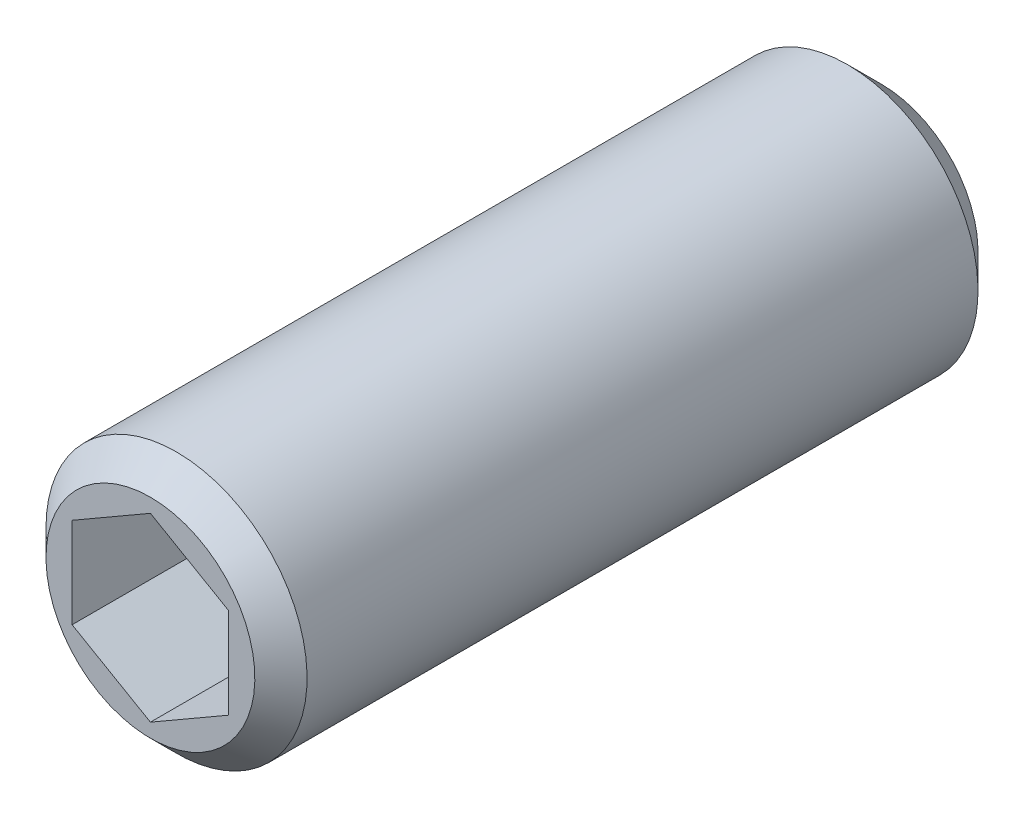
ISO-10303-21;
HEADER;
FILE_DESCRIPTION(('STEP AP214'),'2;1');
FILE_NAME('part.step','',(''),(''),'','','');
FILE_SCHEMA(('AUTOMOTIVE_DESIGN { 1 0 10303 214 1 1 1 1 }'));
ENDSEC;
DATA;
#1=APPLICATION_CONTEXT('core data for automotive mechanical design processes');
#2=APPLICATION_PROTOCOL_DEFINITION('international standard','automotive_design',2000,#1);
#3=PRODUCT_CONTEXT('',#1,'mechanical');
#4=PRODUCT('Part','Part','',(#3));
#5=PRODUCT_RELATED_PRODUCT_CATEGORY('part','',(#4));
#6=PRODUCT_DEFINITION_FORMATION('','',#4);
#7=PRODUCT_DEFINITION_CONTEXT('part definition',#1,'design');
#8=PRODUCT_DEFINITION('design','',#6,#7);
#9=PRODUCT_DEFINITION_SHAPE('','',#8);
#10=(LENGTH_UNIT() NAMED_UNIT(*) SI_UNIT(.MILLI.,.METRE.));
#11=(NAMED_UNIT(*) PLANE_ANGLE_UNIT() SI_UNIT($,.RADIAN.));
#12=(NAMED_UNIT(*) SI_UNIT($,.STERADIAN.) SOLID_ANGLE_UNIT());
#13=UNCERTAINTY_MEASURE_WITH_UNIT(LENGTH_MEASURE(1.E-05),#10,'distance_accuracy_value','');
#14=(GEOMETRIC_REPRESENTATION_CONTEXT(3) GLOBAL_UNCERTAINTY_ASSIGNED_CONTEXT((#13)) GLOBAL_UNIT_ASSIGNED_CONTEXT((#10,
#11,#12)) REPRESENTATION_CONTEXT('',''));
#15=CARTESIAN_POINT('',(0.,0.,0.));
#16=DIRECTION('',(0.,0.,1.));
#17=DIRECTION('',(1.,0.,0.));
#18=AXIS2_PLACEMENT_3D('',#15,#16,#17);
#19=CARTESIAN_POINT('',(0.,0.,14.9));
#20=DIRECTION('',(0.,0.,-1.));
#21=DIRECTION('',(0.,1.,0.));
#22=AXIS2_PLACEMENT_3D('',#19,#20,#21);
#23=PLANE('',#22);
#24=DIRECTION('',(0.866025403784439,0.5,0.));
#25=VECTOR('',#24,1.);
#26=CARTESIAN_POINT('',(0.,-1.73205080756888,14.9));
#27=LINE('',#26,#25);
#28=CARTESIAN_POINT('',(0.,-1.73205080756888,14.9));
#29=VERTEX_POINT('',#28);
#30=CARTESIAN_POINT('',(1.5,-0.866025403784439,14.9));
#31=VERTEX_POINT('',#30);
#32=EDGE_CURVE('E83',#29,#31,#27,.T.);
#33=ORIENTED_EDGE('',*,*,#32,.F.);
#34=DIRECTION('',(0.866025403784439,-0.5,0.));
#35=VECTOR('',#34,1.);
#36=CARTESIAN_POINT('',(-1.5,-0.866025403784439,14.9));
#37=LINE('',#36,#35);
#38=CARTESIAN_POINT('',(-1.5,-0.866025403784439,14.9));
#39=VERTEX_POINT('',#38);
#40=EDGE_CURVE('E29',#39,#29,#37,.T.);
#41=ORIENTED_EDGE('',*,*,#40,.F.);
#42=DIRECTION('',(0.,-1.,0.));
#43=VECTOR('',#42,1.);
#44=CARTESIAN_POINT('',(-1.5,0.866025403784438,14.9));
#45=LINE('',#44,#43);
#46=CARTESIAN_POINT('',(-1.5,0.866025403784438,14.9));
#47=VERTEX_POINT('',#46);
#48=EDGE_CURVE('E98',#47,#39,#45,.T.);
#49=ORIENTED_EDGE('',*,*,#48,.F.);
#50=DIRECTION('',(-0.866025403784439,-0.5,0.));
#51=VECTOR('',#50,1.);
#52=CARTESIAN_POINT('',(0.,1.73205080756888,14.9));
#53=LINE('',#52,#51);
#54=CARTESIAN_POINT('',(0.,1.73205080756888,14.9));
#55=VERTEX_POINT('',#54);
#56=EDGE_CURVE('E92',#55,#47,#53,.T.);
#57=ORIENTED_EDGE('',*,*,#56,.F.);
#58=DIRECTION('',(-0.866025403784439,0.5,0.));
#59=VECTOR('',#58,1.);
#60=CARTESIAN_POINT('',(1.5,0.866025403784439,14.9));
#61=LINE('',#60,#59);
#62=CARTESIAN_POINT('',(1.5,0.866025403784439,14.9));
#63=VERTEX_POINT('',#62);
#64=EDGE_CURVE('E90',#63,#55,#61,.T.);
#65=ORIENTED_EDGE('',*,*,#64,.F.);
#66=DIRECTION('',(0.,1.,0.));
#67=VECTOR('',#66,1.);
#68=CARTESIAN_POINT('',(1.5,-0.866025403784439,14.9));
#69=LINE('',#68,#67);
#70=EDGE_CURVE('E72',#31,#63,#69,.T.);
#71=ORIENTED_EDGE('',*,*,#70,.F.);
#72=EDGE_LOOP('',(#33,#41,#49,#57,#65,#71));
#73=FACE_BOUND('',#72,.T.);
#74=CARTESIAN_POINT('',(0.,0.,14.9));
#75=DIRECTION('',(0.,0.,-1.));
#76=DIRECTION('',(0.,1.,0.));
#77=AXIS2_PLACEMENT_3D('',#74,#75,#76);
#78=CIRCLE('',#77,2.);
#79=CARTESIAN_POINT('',(0.,2.,14.9));
#80=VERTEX_POINT('',#79);
#81=EDGE_CURVE('E9',#80,#80,#78,.F.);
#82=ORIENTED_EDGE('',*,*,#81,.T.);
#83=EDGE_LOOP('',(#82));
#84=FACE_BOUND('',#83,.T.);
#85=ADVANCED_FACE('F14',(#73,#84),#23,.F.);
#86=CARTESIAN_POINT('',(0.,0.,0.9));
#87=DIRECTION('',(0.,0.,1.));
#88=DIRECTION('',(0.,-1.,0.));
#89=AXIS2_PLACEMENT_3D('',#86,#87,#88);
#90=CYLINDRICAL_SURFACE('',#89,2.5);
#91=CARTESIAN_POINT('',(0.,0.,14.4));
#92=DIRECTION('',(0.,0.,-1.));
#93=DIRECTION('',(0.,1.,0.));
#94=AXIS2_PLACEMENT_3D('',#91,#92,#93);
#95=CIRCLE('',#94,2.5);
#96=CARTESIAN_POINT('',(0.,2.5,14.4));
#97=VERTEX_POINT('',#96);
#98=EDGE_CURVE('E22',#97,#97,#95,.T.);
#99=ORIENTED_EDGE('',*,*,#98,.T.);
#100=EDGE_LOOP('',(#99));
#101=FACE_BOUND('',#100,.T.);
#102=CARTESIAN_POINT('',(0.,0.,1.55));
#103=DIRECTION('',(0.,0.,-1.));
#104=DIRECTION('',(-1.,0.,0.));
#105=AXIS2_PLACEMENT_3D('',#102,#103,#104);
#106=CIRCLE('',#105,2.5);
#107=CARTESIAN_POINT('',(-2.5,0.,1.55));
#108=VERTEX_POINT('',#107);
#109=EDGE_CURVE('E267',#108,#108,#106,.T.);
#110=ORIENTED_EDGE('',*,*,#109,.F.);
#111=EDGE_LOOP('',(#110));
#112=FACE_BOUND('',#111,.T.);
#113=ADVANCED_FACE('F16',(#101,#112),#90,.T.);
#114=CARTESIAN_POINT('',(0.,0.,14.4));
#115=DIRECTION('',(0.,0.,-1.));
#116=DIRECTION('',(0.,1.,0.));
#117=AXIS2_PLACEMENT_3D('',#114,#115,#116);
#118=CONICAL_SURFACE('',#117,2.5,0.78539816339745);
#119=ORIENTED_EDGE('',*,*,#81,.F.);
#120=EDGE_LOOP('',(#119));
#121=FACE_BOUND('',#120,.T.);
#122=ORIENTED_EDGE('',*,*,#98,.F.);
#123=EDGE_LOOP('',(#122));
#124=FACE_BOUND('',#123,.T.);
#125=ADVANCED_FACE('F132',(#121,#124),#118,.T.);
#126=CARTESIAN_POINT('',(-1.5,-0.866025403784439,11.9));
#127=DIRECTION('',(-0.5,-0.866025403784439,0.));
#128=DIRECTION('',(-0.866025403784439,0.5,0.));
#129=AXIS2_PLACEMENT_3D('',#126,#127,#128);
#130=PLANE('',#129);
#131=ORIENTED_EDGE('',*,*,#40,.T.);
#132=DIRECTION('',(0.,0.,1.));
#133=VECTOR('',#132,1.);
#134=CARTESIAN_POINT('',(0.,-1.73205080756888,11.9));
#135=LINE('',#134,#133);
#136=CARTESIAN_POINT('',(0.,-1.73205080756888,11.9));
#137=VERTEX_POINT('',#136);
#138=EDGE_CURVE('E80',#137,#29,#135,.T.);
#139=ORIENTED_EDGE('',*,*,#138,.F.);
#140=DIRECTION('',(0.866025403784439,-0.5,0.));
#141=VECTOR('',#140,1.);
#142=CARTESIAN_POINT('',(-1.5,-0.866025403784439,11.9));
#143=LINE('',#142,#141);
#144=CARTESIAN_POINT('',(-1.5,-0.866025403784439,11.9));
#145=VERTEX_POINT('',#144);
#146=EDGE_CURVE('E100',#145,#137,#143,.T.);
#147=ORIENTED_EDGE('',*,*,#146,.F.);
#148=DIRECTION('',(0.,0.,1.));
#149=VECTOR('',#148,1.);
#150=CARTESIAN_POINT('',(-1.5,-0.866025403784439,11.9));
#151=LINE('',#150,#149);
#152=EDGE_CURVE('E36',#145,#39,#151,.T.);
#153=ORIENTED_EDGE('',*,*,#152,.T.);
#154=EDGE_LOOP('',(#131,#139,#147,#153));
#155=FACE_BOUND('',#154,.T.);
#156=ADVANCED_FACE('F134',(#155),#130,.F.);
#157=CARTESIAN_POINT('',(-1.5,0.866025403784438,11.9));
#158=DIRECTION('',(-1.,0.,0.));
#159=DIRECTION('',(0.,1.,0.));
#160=AXIS2_PLACEMENT_3D('',#157,#158,#159);
#161=PLANE('',#160);
#162=ORIENTED_EDGE('',*,*,#48,.T.);
#163=ORIENTED_EDGE('',*,*,#152,.F.);
#164=DIRECTION('',(0.,-1.,0.));
#165=VECTOR('',#164,1.);
#166=CARTESIAN_POINT('',(-1.5,0.866025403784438,11.9));
#167=LINE('',#166,#165);
#168=CARTESIAN_POINT('',(-1.5,0.866025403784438,11.9));
#169=VERTEX_POINT('',#168);
#170=EDGE_CURVE('E112',#169,#145,#167,.T.);
#171=ORIENTED_EDGE('',*,*,#170,.F.);
#172=DIRECTION('',(0.,0.,1.));
#173=VECTOR('',#172,1.);
#174=CARTESIAN_POINT('',(-1.5,0.866025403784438,11.9));
#175=LINE('',#174,#173);
#176=EDGE_CURVE('E117',#169,#47,#175,.T.);
#177=ORIENTED_EDGE('',*,*,#176,.T.);
#178=EDGE_LOOP('',(#162,#163,#171,#177));
#179=FACE_BOUND('',#178,.T.);
#180=ADVANCED_FACE('F143',(#179),#161,.F.);
#181=CARTESIAN_POINT('',(0.,1.73205080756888,11.9));
#182=DIRECTION('',(-0.5,0.866025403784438,0.));
#183=DIRECTION('',(0.866025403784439,0.5,0.));
#184=AXIS2_PLACEMENT_3D('',#181,#182,#183);
#185=PLANE('',#184);
#186=ORIENTED_EDGE('',*,*,#56,.T.);
#187=ORIENTED_EDGE('',*,*,#176,.F.);
#188=DIRECTION('',(-0.866025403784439,-0.5,0.));
#189=VECTOR('',#188,1.);
#190=CARTESIAN_POINT('',(0.,1.73205080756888,11.9));
#191=LINE('',#190,#189);
#192=CARTESIAN_POINT('',(0.,1.73205080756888,11.9));
#193=VERTEX_POINT('',#192);
#194=EDGE_CURVE('E109',#193,#169,#191,.T.);
#195=ORIENTED_EDGE('',*,*,#194,.F.);
#196=DIRECTION('',(0.,0.,1.));
#197=VECTOR('',#196,1.);
#198=CARTESIAN_POINT('',(0.,1.73205080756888,11.9));
#199=LINE('',#198,#197);
#200=EDGE_CURVE('E119',#193,#55,#199,.T.);
#201=ORIENTED_EDGE('',*,*,#200,.T.);
#202=EDGE_LOOP('',(#186,#187,#195,#201));
#203=FACE_BOUND('',#202,.T.);
#204=ADVANCED_FACE('F180',(#203),#185,.F.);
#205=CARTESIAN_POINT('',(1.5,0.866025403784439,11.9));
#206=DIRECTION('',(0.5,0.866025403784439,0.));
#207=DIRECTION('',(0.866025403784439,-0.5,0.));
#208=AXIS2_PLACEMENT_3D('',#205,#206,#207);
#209=PLANE('',#208);
#210=ORIENTED_EDGE('',*,*,#64,.T.);
#211=ORIENTED_EDGE('',*,*,#200,.F.);
#212=DIRECTION('',(-0.866025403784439,0.5,0.));
#213=VECTOR('',#212,1.);
#214=CARTESIAN_POINT('',(1.5,0.866025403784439,11.9));
#215=LINE('',#214,#213);
#216=CARTESIAN_POINT('',(1.5,0.866025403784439,11.9));
#217=VERTEX_POINT('',#216);
#218=EDGE_CURVE('E106',#217,#193,#215,.T.);
#219=ORIENTED_EDGE('',*,*,#218,.F.);
#220=DIRECTION('',(0.,0.,1.));
#221=VECTOR('',#220,1.);
#222=CARTESIAN_POINT('',(1.5,0.866025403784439,11.9));
#223=LINE('',#222,#221);
#224=EDGE_CURVE('E79',#217,#63,#223,.T.);
#225=ORIENTED_EDGE('',*,*,#224,.T.);
#226=EDGE_LOOP('',(#210,#211,#219,#225));
#227=FACE_BOUND('',#226,.T.);
#228=ADVANCED_FACE('F183',(#227),#209,.F.);
#229=CARTESIAN_POINT('',(1.5,-0.866025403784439,11.9));
#230=DIRECTION('',(1.,0.,0.));
#231=DIRECTION('',(0.,-1.,0.));
#232=AXIS2_PLACEMENT_3D('',#229,#230,#231);
#233=PLANE('',#232);
#234=ORIENTED_EDGE('',*,*,#70,.T.);
#235=ORIENTED_EDGE('',*,*,#224,.F.);
#236=DIRECTION('',(0.,1.,0.));
#237=VECTOR('',#236,1.);
#238=CARTESIAN_POINT('',(1.5,-0.866025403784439,11.9));
#239=LINE('',#238,#237);
#240=CARTESIAN_POINT('',(1.5,-0.866025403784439,11.9));
#241=VERTEX_POINT('',#240);
#242=EDGE_CURVE('E75',#241,#217,#239,.T.);
#243=ORIENTED_EDGE('',*,*,#242,.F.);
#244=DIRECTION('',(0.,0.,1.));
#245=VECTOR('',#244,1.);
#246=CARTESIAN_POINT('',(1.5,-0.866025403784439,11.9));
#247=LINE('',#246,#245);
#248=EDGE_CURVE('E68',#241,#31,#247,.T.);
#249=ORIENTED_EDGE('',*,*,#248,.T.);
#250=EDGE_LOOP('',(#234,#235,#243,#249));
#251=FACE_BOUND('',#250,.T.);
#252=ADVANCED_FACE('F70',(#251),#233,.F.);
#253=CARTESIAN_POINT('',(0.,-1.73205080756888,11.9));
#254=DIRECTION('',(0.5,-0.866025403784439,0.));
#255=DIRECTION('',(-0.866025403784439,-0.5,0.));
#256=AXIS2_PLACEMENT_3D('',#253,#254,#255);
#257=PLANE('',#256);
#258=ORIENTED_EDGE('',*,*,#32,.T.);
#259=ORIENTED_EDGE('',*,*,#248,.F.);
#260=DIRECTION('',(0.866025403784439,0.5,0.));
#261=VECTOR('',#260,1.);
#262=CARTESIAN_POINT('',(0.,-1.73205080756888,11.9));
#263=LINE('',#262,#261);
#264=EDGE_CURVE('E103',#137,#241,#263,.T.);
#265=ORIENTED_EDGE('',*,*,#264,.F.);
#266=ORIENTED_EDGE('',*,*,#138,.T.);
#267=EDGE_LOOP('',(#258,#259,#265,#266));
#268=FACE_BOUND('',#267,.T.);
#269=ADVANCED_FACE('F84',(#268),#257,.F.);
#270=CARTESIAN_POINT('',(-1.5,-0.866025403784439,11.9));
#271=DIRECTION('',(0.,0.,-1.));
#272=DIRECTION('',(0.,1.,0.));
#273=AXIS2_PLACEMENT_3D('',#270,#271,#272);
#274=PLANE('',#273);
#275=ORIENTED_EDGE('',*,*,#146,.T.);
#276=ORIENTED_EDGE('',*,*,#264,.T.);
#277=ORIENTED_EDGE('',*,*,#242,.T.);
#278=ORIENTED_EDGE('',*,*,#218,.T.);
#279=ORIENTED_EDGE('',*,*,#194,.T.);
#280=ORIENTED_EDGE('',*,*,#170,.T.);
#281=EDGE_LOOP('',(#275,#276,#277,#278,#279,#280));
#282=FACE_BOUND('',#281,.T.);
#283=ADVANCED_FACE('F167',(#282),#274,.F.);
#284=CARTESIAN_POINT('',(0.,0.,0.9));
#285=DIRECTION('',(0.,0.,1.));
#286=DIRECTION('',(1.,0.,0.));
#287=AXIS2_PLACEMENT_3D('',#284,#285,#286);
#288=CONICAL_SURFACE('',#287,1.85,0.785398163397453);
#289=ORIENTED_EDGE('',*,*,#109,.T.);
#290=EDGE_LOOP('',(#289));
#291=FACE_BOUND('',#290,.T.);
#292=CARTESIAN_POINT('',(0.,0.,0.9));
#293=DIRECTION('',(0.,0.,-1.));
#294=DIRECTION('',(0.,1.,0.));
#295=AXIS2_PLACEMENT_3D('',#292,#293,#294);
#296=CIRCLE('',#295,1.85);
#297=CARTESIAN_POINT('',(0.,1.85,0.9));
#298=VERTEX_POINT('',#297);
#299=EDGE_CURVE('E116',#298,#298,#296,.F.);
#300=ORIENTED_EDGE('',*,*,#299,.T.);
#301=EDGE_LOOP('',(#300));
#302=FACE_BOUND('',#301,.T.);
#303=ADVANCED_FACE('F160',(#291,#302),#288,.T.);
#304=CARTESIAN_POINT('',(0.,0.,1.5));
#305=DIRECTION('',(0.,0.,-1.));
#306=DIRECTION('',(1.,0.,0.));
#307=AXIS2_PLACEMENT_3D('',#304,#305,#306);
#308=SPHERICAL_SURFACE('',#307,1.5);
#309=CARTESIAN_POINT('',(0.,0.,0.9));
#310=DIRECTION('',(0.,0.,-1.));
#311=DIRECTION('',(0.,1.,0.));
#312=AXIS2_PLACEMENT_3D('',#309,#310,#311);
#313=CIRCLE('',#312,1.37477270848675);
#314=CARTESIAN_POINT('',(0.,1.37477270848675,0.9));
#315=VERTEX_POINT('',#314);
#316=EDGE_CURVE('E123',#315,#315,#313,.F.);
#317=ORIENTED_EDGE('',*,*,#316,.F.);
#318=EDGE_LOOP('',(#317));
#319=FACE_BOUND('',#318,.T.);
#320=ADVANCED_FACE('F152',(#319),#308,.T.);
#321=CARTESIAN_POINT('',(0.,0.,0.9));
#322=DIRECTION('',(0.,0.,-1.));
#323=DIRECTION('',(0.,1.,0.));
#324=AXIS2_PLACEMENT_3D('',#321,#322,#323);
#325=PLANE('',#324);
#326=ORIENTED_EDGE('',*,*,#299,.F.);
#327=EDGE_LOOP('',(#326));
#328=FACE_BOUND('',#327,.T.);
#329=ORIENTED_EDGE('',*,*,#316,.T.);
#330=EDGE_LOOP('',(#329));
#331=FACE_BOUND('',#330,.T.);
#332=ADVANCED_FACE('F153',(#328,#331),#325,.T.);
#333=CLOSED_SHELL('',(#85,#113,#125,#156,#180,#204,#228,#252,#269,#283,#303,#320,#332));
#334=MANIFOLD_SOLID_BREP('B1',#333);
#335=ADVANCED_BREP_SHAPE_REPRESENTATION('',(#18,#334),#14);
#336=SHAPE_DEFINITION_REPRESENTATION(#9,#335);
ENDSEC;
END-ISO-10303-21;
